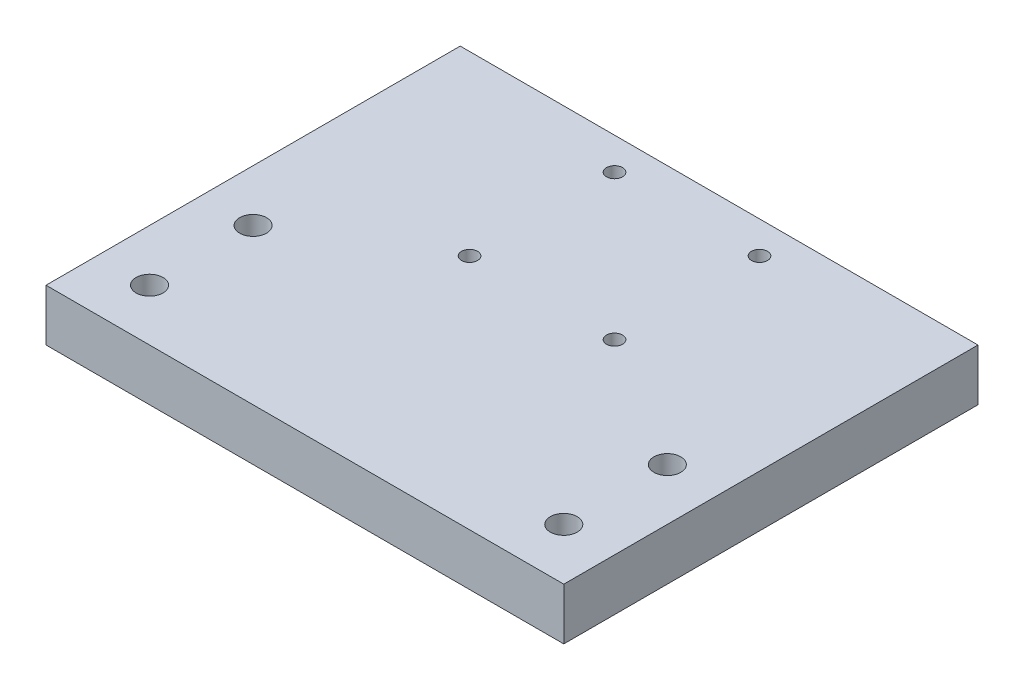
ISO-10303-21;
HEADER;
FILE_DESCRIPTION(('STEP AP214'),'2;1');
FILE_NAME('part.step','',(''),(''),'','','');
FILE_SCHEMA(('AUTOMOTIVE_DESIGN { 1 0 10303 214 1 1 1 1 }'));
ENDSEC;
DATA;
#1=APPLICATION_CONTEXT('core data for automotive mechanical design processes');
#2=APPLICATION_PROTOCOL_DEFINITION('international standard','automotive_design',2000,#1);
#3=PRODUCT_CONTEXT('',#1,'mechanical');
#4=PRODUCT('Part','Part','',(#3));
#5=PRODUCT_RELATED_PRODUCT_CATEGORY('part','',(#4));
#6=PRODUCT_DEFINITION_FORMATION('','',#4);
#7=PRODUCT_DEFINITION_CONTEXT('part definition',#1,'design');
#8=PRODUCT_DEFINITION('design','',#6,#7);
#9=PRODUCT_DEFINITION_SHAPE('','',#8);
#10=(LENGTH_UNIT() NAMED_UNIT(*) SI_UNIT(.MILLI.,.METRE.));
#11=(NAMED_UNIT(*) PLANE_ANGLE_UNIT() SI_UNIT($,.RADIAN.));
#12=(NAMED_UNIT(*) SI_UNIT($,.STERADIAN.) SOLID_ANGLE_UNIT());
#13=UNCERTAINTY_MEASURE_WITH_UNIT(LENGTH_MEASURE(1.E-05),#10,'distance_accuracy_value','');
#14=(GEOMETRIC_REPRESENTATION_CONTEXT(3) GLOBAL_UNCERTAINTY_ASSIGNED_CONTEXT((#13)) GLOBAL_UNIT_ASSIGNED_CONTEXT((#10,
#11,#12)) REPRESENTATION_CONTEXT('',''));
#15=CARTESIAN_POINT('',(0.,0.,0.));
#16=DIRECTION('',(0.,0.,1.));
#17=DIRECTION('',(1.,0.,0.));
#18=AXIS2_PLACEMENT_3D('',#15,#16,#17);
#19=CARTESIAN_POINT('',(50.,10.,-40.));
#20=DIRECTION('',(-1.,0.,0.));
#21=DIRECTION('',(0.,0.,1.));
#22=AXIS2_PLACEMENT_3D('',#19,#20,#21);
#23=PLANE('',#22);
#24=DIRECTION('',(0.,0.,-1.));
#25=VECTOR('',#24,1.);
#26=CARTESIAN_POINT('',(50.,0.,-40.));
#27=LINE('',#26,#25);
#28=CARTESIAN_POINT('',(50.,0.,40.));
#29=VERTEX_POINT('',#28);
#30=CARTESIAN_POINT('',(50.,0.,-40.));
#31=VERTEX_POINT('',#30);
#32=EDGE_CURVE('E106',#29,#31,#27,.T.);
#33=ORIENTED_EDGE('',*,*,#32,.T.);
#34=DIRECTION('',(0.,-1.,0.));
#35=VECTOR('',#34,1.);
#36=CARTESIAN_POINT('',(50.,10.,-40.));
#37=LINE('',#36,#35);
#38=CARTESIAN_POINT('',(50.,10.,-40.));
#39=VERTEX_POINT('',#38);
#40=EDGE_CURVE('E11',#39,#31,#37,.T.);
#41=ORIENTED_EDGE('',*,*,#40,.F.);
#42=DIRECTION('',(0.,0.,-1.));
#43=VECTOR('',#42,1.);
#44=CARTESIAN_POINT('',(50.,10.,-40.));
#45=LINE('',#44,#43);
#46=CARTESIAN_POINT('',(50.,10.,40.));
#47=VERTEX_POINT('',#46);
#48=EDGE_CURVE('E91',#47,#39,#45,.T.);
#49=ORIENTED_EDGE('',*,*,#48,.F.);
#50=DIRECTION('',(0.,-1.,0.));
#51=VECTOR('',#50,1.);
#52=CARTESIAN_POINT('',(50.,10.,40.));
#53=LINE('',#52,#51);
#54=EDGE_CURVE('E105',#47,#29,#53,.T.);
#55=ORIENTED_EDGE('',*,*,#54,.T.);
#56=EDGE_LOOP('',(#33,#41,#49,#55));
#57=FACE_BOUND('',#56,.T.);
#58=ADVANCED_FACE('F43',(#57),#23,.F.);
#59=CARTESIAN_POINT('',(-50.,10.,-40.));
#60=DIRECTION('',(0.,0.,1.));
#61=DIRECTION('',(1.,0.,0.));
#62=AXIS2_PLACEMENT_3D('',#59,#60,#61);
#63=PLANE('',#62);
#64=DIRECTION('',(-1.,0.,0.));
#65=VECTOR('',#64,1.);
#66=CARTESIAN_POINT('',(-50.,0.,-40.));
#67=LINE('',#66,#65);
#68=CARTESIAN_POINT('',(-50.,0.,-40.));
#69=VERTEX_POINT('',#68);
#70=EDGE_CURVE('E96',#31,#69,#67,.T.);
#71=ORIENTED_EDGE('',*,*,#70,.T.);
#72=DIRECTION('',(0.,-1.,0.));
#73=VECTOR('',#72,1.);
#74=CARTESIAN_POINT('',(-50.,10.,-40.));
#75=LINE('',#74,#73);
#76=CARTESIAN_POINT('',(-50.,10.,-40.));
#77=VERTEX_POINT('',#76);
#78=EDGE_CURVE('E51',#77,#69,#75,.T.);
#79=ORIENTED_EDGE('',*,*,#78,.F.);
#80=DIRECTION('',(-1.,0.,0.));
#81=VECTOR('',#80,1.);
#82=CARTESIAN_POINT('',(-50.,10.,-40.));
#83=LINE('',#82,#81);
#84=EDGE_CURVE('E90',#39,#77,#83,.T.);
#85=ORIENTED_EDGE('',*,*,#84,.F.);
#86=ORIENTED_EDGE('',*,*,#40,.T.);
#87=EDGE_LOOP('',(#71,#79,#85,#86));
#88=FACE_BOUND('',#87,.T.);
#89=ADVANCED_FACE('F97',(#88),#63,.F.);
#90=CARTESIAN_POINT('',(-50.,10.,-40.));
#91=DIRECTION('',(1.,0.,0.));
#92=DIRECTION('',(0.,0.,-1.));
#93=AXIS2_PLACEMENT_3D('',#90,#91,#92);
#94=PLANE('',#93);
#95=DIRECTION('',(0.,0.,1.));
#96=VECTOR('',#95,1.);
#97=CARTESIAN_POINT('',(-50.,0.,-40.));
#98=LINE('',#97,#96);
#99=CARTESIAN_POINT('',(-50.,0.,40.));
#100=VERTEX_POINT('',#99);
#101=EDGE_CURVE('E77',#69,#100,#98,.T.);
#102=ORIENTED_EDGE('',*,*,#101,.T.);
#103=DIRECTION('',(0.,-1.,0.));
#104=VECTOR('',#103,1.);
#105=CARTESIAN_POINT('',(-50.,10.,40.));
#106=LINE('',#105,#104);
#107=CARTESIAN_POINT('',(-50.,10.,40.));
#108=VERTEX_POINT('',#107);
#109=EDGE_CURVE('E100',#108,#100,#106,.T.);
#110=ORIENTED_EDGE('',*,*,#109,.F.);
#111=DIRECTION('',(0.,0.,1.));
#112=VECTOR('',#111,1.);
#113=CARTESIAN_POINT('',(-50.,10.,-40.));
#114=LINE('',#113,#112);
#115=EDGE_CURVE('E94',#77,#108,#114,.T.);
#116=ORIENTED_EDGE('',*,*,#115,.F.);
#117=ORIENTED_EDGE('',*,*,#78,.T.);
#118=EDGE_LOOP('',(#102,#110,#116,#117));
#119=FACE_BOUND('',#118,.T.);
#120=ADVANCED_FACE('F99',(#119),#94,.F.);
#121=CARTESIAN_POINT('',(-50.,10.,40.));
#122=DIRECTION('',(0.,0.,-1.));
#123=DIRECTION('',(-1.,0.,0.));
#124=AXIS2_PLACEMENT_3D('',#121,#122,#123);
#125=PLANE('',#124);
#126=DIRECTION('',(1.,0.,0.));
#127=VECTOR('',#126,1.);
#128=CARTESIAN_POINT('',(-50.,0.,40.));
#129=LINE('',#128,#127);
#130=EDGE_CURVE('E81',#100,#29,#129,.T.);
#131=ORIENTED_EDGE('',*,*,#130,.T.);
#132=ORIENTED_EDGE('',*,*,#54,.F.);
#133=DIRECTION('',(1.,0.,0.));
#134=VECTOR('',#133,1.);
#135=CARTESIAN_POINT('',(-50.,10.,40.));
#136=LINE('',#135,#134);
#137=EDGE_CURVE('E56',#108,#47,#136,.T.);
#138=ORIENTED_EDGE('',*,*,#137,.F.);
#139=ORIENTED_EDGE('',*,*,#109,.T.);
#140=EDGE_LOOP('',(#131,#132,#138,#139));
#141=FACE_BOUND('',#140,.T.);
#142=ADVANCED_FACE('F112',(#141),#125,.F.);
#143=CARTESIAN_POINT('',(0.,10.,0.));
#144=DIRECTION('',(0.,1.,0.));
#145=DIRECTION('',(0.,0.,1.));
#146=AXIS2_PLACEMENT_3D('',#143,#144,#145);
#147=PLANE('',#146);
#148=CARTESIAN_POINT('',(14.,10.,-5.80000000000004));
#149=DIRECTION('',(0.,1.,0.));
#150=DIRECTION('',(0.,0.,1.));
#151=AXIS2_PLACEMENT_3D('',#148,#149,#150);
#152=CIRCLE('',#151,1.55);
#153=CARTESIAN_POINT('',(14.,10.,-4.25000000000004));
#154=VERTEX_POINT('',#153);
#155=EDGE_CURVE('E146',#154,#154,#152,.T.);
#156=ORIENTED_EDGE('',*,*,#155,.F.);
#157=EDGE_LOOP('',(#156));
#158=FACE_BOUND('',#157,.T.);
#159=CARTESIAN_POINT('',(-14.,10.,-33.8));
#160=DIRECTION('',(0.,1.,0.));
#161=DIRECTION('',(0.,0.,1.));
#162=AXIS2_PLACEMENT_3D('',#159,#160,#161);
#163=CIRCLE('',#162,1.55);
#164=CARTESIAN_POINT('',(-14.,10.,-32.25));
#165=VERTEX_POINT('',#164);
#166=EDGE_CURVE('E152',#165,#165,#163,.T.);
#167=ORIENTED_EDGE('',*,*,#166,.F.);
#168=EDGE_LOOP('',(#167));
#169=FACE_BOUND('',#168,.T.);
#170=CARTESIAN_POINT('',(-14.,10.,-5.80000000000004));
#171=DIRECTION('',(0.,1.,0.));
#172=DIRECTION('',(0.,0.,1.));
#173=AXIS2_PLACEMENT_3D('',#170,#171,#172);
#174=CIRCLE('',#173,1.55);
#175=CARTESIAN_POINT('',(-14.,10.,-4.25000000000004));
#176=VERTEX_POINT('',#175);
#177=EDGE_CURVE('E155',#176,#176,#174,.T.);
#178=ORIENTED_EDGE('',*,*,#177,.F.);
#179=EDGE_LOOP('',(#178));
#180=FACE_BOUND('',#179,.T.);
#181=CARTESIAN_POINT('',(14.,10.,-33.8));
#182=DIRECTION('',(0.,1.,0.));
#183=DIRECTION('',(0.,0.,1.));
#184=AXIS2_PLACEMENT_3D('',#181,#182,#183);
#185=CIRCLE('',#184,1.55);
#186=CARTESIAN_POINT('',(14.,10.,-32.25));
#187=VERTEX_POINT('',#186);
#188=EDGE_CURVE('E144',#187,#187,#185,.T.);
#189=ORIENTED_EDGE('',*,*,#188,.F.);
#190=EDGE_LOOP('',(#189));
#191=FACE_BOUND('',#190,.T.);
#192=CARTESIAN_POINT('',(40.,10.,9.99999999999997));
#193=DIRECTION('',(0.,-1.,0.));
#194=DIRECTION('',(0.,0.,-1.));
#195=AXIS2_PLACEMENT_3D('',#192,#193,#194);
#196=CIRCLE('',#195,2.6);
#197=CARTESIAN_POINT('',(40.,10.,7.39999999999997));
#198=VERTEX_POINT('',#197);
#199=EDGE_CURVE('E132',#198,#198,#196,.T.);
#200=ORIENTED_EDGE('',*,*,#199,.T.);
#201=EDGE_LOOP('',(#200));
#202=FACE_BOUND('',#201,.T.);
#203=CARTESIAN_POINT('',(-40.,10.,30.));
#204=DIRECTION('',(0.,-1.,0.));
#205=DIRECTION('',(0.,0.,-1.));
#206=AXIS2_PLACEMENT_3D('',#203,#204,#205);
#207=CIRCLE('',#206,2.6);
#208=CARTESIAN_POINT('',(-40.,10.,27.4));
#209=VERTEX_POINT('',#208);
#210=EDGE_CURVE('E129',#209,#209,#207,.T.);
#211=ORIENTED_EDGE('',*,*,#210,.T.);
#212=EDGE_LOOP('',(#211));
#213=FACE_BOUND('',#212,.T.);
#214=CARTESIAN_POINT('',(-40.,10.,9.99999999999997));
#215=DIRECTION('',(0.,-1.,0.));
#216=DIRECTION('',(0.,0.,-1.));
#217=AXIS2_PLACEMENT_3D('',#214,#215,#216);
#218=CIRCLE('',#217,2.6);
#219=CARTESIAN_POINT('',(-40.,10.,7.39999999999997));
#220=VERTEX_POINT('',#219);
#221=EDGE_CURVE('E140',#220,#220,#218,.T.);
#222=ORIENTED_EDGE('',*,*,#221,.T.);
#223=EDGE_LOOP('',(#222));
#224=FACE_BOUND('',#223,.T.);
#225=CARTESIAN_POINT('',(40.,10.,30.));
#226=DIRECTION('',(0.,-1.,0.));
#227=DIRECTION('',(0.,0.,-1.));
#228=AXIS2_PLACEMENT_3D('',#225,#226,#227);
#229=CIRCLE('',#228,2.6);
#230=CARTESIAN_POINT('',(40.,10.,27.4));
#231=VERTEX_POINT('',#230);
#232=EDGE_CURVE('E107',#231,#231,#229,.T.);
#233=ORIENTED_EDGE('',*,*,#232,.T.);
#234=EDGE_LOOP('',(#233));
#235=FACE_BOUND('',#234,.T.);
#236=ORIENTED_EDGE('',*,*,#48,.T.);
#237=ORIENTED_EDGE('',*,*,#84,.T.);
#238=ORIENTED_EDGE('',*,*,#115,.T.);
#239=ORIENTED_EDGE('',*,*,#137,.T.);
#240=EDGE_LOOP('',(#236,#237,#238,#239));
#241=FACE_BOUND('',#240,.T.);
#242=ADVANCED_FACE('F86',(#158,#169,#180,#191,#202,#213,#224,#235,#241),#147,.T.);
#243=CARTESIAN_POINT('',(0.,0.,0.));
#244=DIRECTION('',(0.,1.,0.));
#245=DIRECTION('',(0.,0.,1.));
#246=AXIS2_PLACEMENT_3D('',#243,#244,#245);
#247=PLANE('',#246);
#248=CARTESIAN_POINT('',(14.,0.,-5.80000000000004));
#249=DIRECTION('',(0.,1.,0.));
#250=DIRECTION('',(0.,0.,1.));
#251=AXIS2_PLACEMENT_3D('',#248,#249,#250);
#252=CIRCLE('',#251,1.55);
#253=CARTESIAN_POINT('',(14.,0.,-4.25000000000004));
#254=VERTEX_POINT('',#253);
#255=EDGE_CURVE('E159',#254,#254,#252,.T.);
#256=ORIENTED_EDGE('',*,*,#255,.T.);
#257=EDGE_LOOP('',(#256));
#258=FACE_BOUND('',#257,.T.);
#259=CARTESIAN_POINT('',(-14.,0.,-33.8));
#260=DIRECTION('',(0.,1.,0.));
#261=DIRECTION('',(0.,0.,1.));
#262=AXIS2_PLACEMENT_3D('',#259,#260,#261);
#263=CIRCLE('',#262,1.55);
#264=CARTESIAN_POINT('',(-14.,0.,-32.25));
#265=VERTEX_POINT('',#264);
#266=EDGE_CURVE('E147',#265,#265,#263,.T.);
#267=ORIENTED_EDGE('',*,*,#266,.T.);
#268=EDGE_LOOP('',(#267));
#269=FACE_BOUND('',#268,.T.);
#270=CARTESIAN_POINT('',(-14.,0.,-5.80000000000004));
#271=DIRECTION('',(0.,1.,0.));
#272=DIRECTION('',(0.,0.,1.));
#273=AXIS2_PLACEMENT_3D('',#270,#271,#272);
#274=CIRCLE('',#273,1.55);
#275=CARTESIAN_POINT('',(-14.,0.,-4.25000000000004));
#276=VERTEX_POINT('',#275);
#277=EDGE_CURVE('E162',#276,#276,#274,.T.);
#278=ORIENTED_EDGE('',*,*,#277,.T.);
#279=EDGE_LOOP('',(#278));
#280=FACE_BOUND('',#279,.T.);
#281=CARTESIAN_POINT('',(14.,0.,-33.8));
#282=DIRECTION('',(0.,1.,0.));
#283=DIRECTION('',(0.,0.,1.));
#284=AXIS2_PLACEMENT_3D('',#281,#282,#283);
#285=CIRCLE('',#284,1.55);
#286=CARTESIAN_POINT('',(14.,0.,-32.25));
#287=VERTEX_POINT('',#286);
#288=EDGE_CURVE('E142',#287,#287,#285,.T.);
#289=ORIENTED_EDGE('',*,*,#288,.T.);
#290=EDGE_LOOP('',(#289));
#291=FACE_BOUND('',#290,.T.);
#292=CARTESIAN_POINT('',(40.,0.,9.99999999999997));
#293=DIRECTION('',(0.,-1.,0.));
#294=DIRECTION('',(0.,0.,-1.));
#295=AXIS2_PLACEMENT_3D('',#292,#293,#294);
#296=CIRCLE('',#295,2.6);
#297=CARTESIAN_POINT('',(40.,0.,7.39999999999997));
#298=VERTEX_POINT('',#297);
#299=EDGE_CURVE('E124',#298,#298,#296,.T.);
#300=ORIENTED_EDGE('',*,*,#299,.F.);
#301=EDGE_LOOP('',(#300));
#302=FACE_BOUND('',#301,.T.);
#303=CARTESIAN_POINT('',(-40.,0.,30.));
#304=DIRECTION('',(0.,-1.,0.));
#305=DIRECTION('',(0.,0.,-1.));
#306=AXIS2_PLACEMENT_3D('',#303,#304,#305);
#307=CIRCLE('',#306,2.6);
#308=CARTESIAN_POINT('',(-40.,0.,27.4));
#309=VERTEX_POINT('',#308);
#310=EDGE_CURVE('E128',#309,#309,#307,.T.);
#311=ORIENTED_EDGE('',*,*,#310,.F.);
#312=EDGE_LOOP('',(#311));
#313=FACE_BOUND('',#312,.T.);
#314=CARTESIAN_POINT('',(-40.,0.,9.99999999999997));
#315=DIRECTION('',(0.,-1.,0.));
#316=DIRECTION('',(0.,0.,-1.));
#317=AXIS2_PLACEMENT_3D('',#314,#315,#316);
#318=CIRCLE('',#317,2.6);
#319=CARTESIAN_POINT('',(-40.,0.,7.39999999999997));
#320=VERTEX_POINT('',#319);
#321=EDGE_CURVE('E127',#320,#320,#318,.T.);
#322=ORIENTED_EDGE('',*,*,#321,.F.);
#323=EDGE_LOOP('',(#322));
#324=FACE_BOUND('',#323,.T.);
#325=CARTESIAN_POINT('',(40.,0.,30.));
#326=DIRECTION('',(0.,-1.,0.));
#327=DIRECTION('',(0.,0.,-1.));
#328=AXIS2_PLACEMENT_3D('',#325,#326,#327);
#329=CIRCLE('',#328,2.6);
#330=CARTESIAN_POINT('',(40.,0.,27.4));
#331=VERTEX_POINT('',#330);
#332=EDGE_CURVE('E119',#331,#331,#329,.T.);
#333=ORIENTED_EDGE('',*,*,#332,.F.);
#334=EDGE_LOOP('',(#333));
#335=FACE_BOUND('',#334,.T.);
#336=ORIENTED_EDGE('',*,*,#32,.F.);
#337=ORIENTED_EDGE('',*,*,#130,.F.);
#338=ORIENTED_EDGE('',*,*,#101,.F.);
#339=ORIENTED_EDGE('',*,*,#70,.F.);
#340=EDGE_LOOP('',(#336,#337,#338,#339));
#341=FACE_BOUND('',#340,.T.);
#342=ADVANCED_FACE('F120',(#258,#269,#280,#291,#302,#313,#324,#335,#341),#247,.F.);
#343=CARTESIAN_POINT('',(40.,10.,30.));
#344=DIRECTION('',(0.,-1.,0.));
#345=DIRECTION('',(0.,0.,-1.));
#346=AXIS2_PLACEMENT_3D('',#343,#344,#345);
#347=CYLINDRICAL_SURFACE('',#346,2.6);
#348=ORIENTED_EDGE('',*,*,#232,.F.);
#349=EDGE_LOOP('',(#348));
#350=FACE_BOUND('',#349,.T.);
#351=ORIENTED_EDGE('',*,*,#332,.T.);
#352=EDGE_LOOP('',(#351));
#353=FACE_BOUND('',#352,.T.);
#354=ADVANCED_FACE('F183',(#350,#353),#347,.F.);
#355=CARTESIAN_POINT('',(-40.,10.,9.99999999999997));
#356=DIRECTION('',(0.,-1.,0.));
#357=DIRECTION('',(0.,0.,-1.));
#358=AXIS2_PLACEMENT_3D('',#355,#356,#357);
#359=CYLINDRICAL_SURFACE('',#358,2.6);
#360=ORIENTED_EDGE('',*,*,#221,.F.);
#361=EDGE_LOOP('',(#360));
#362=FACE_BOUND('',#361,.T.);
#363=ORIENTED_EDGE('',*,*,#321,.T.);
#364=EDGE_LOOP('',(#363));
#365=FACE_BOUND('',#364,.T.);
#366=ADVANCED_FACE('F190',(#362,#365),#359,.F.);
#367=CARTESIAN_POINT('',(-40.,10.,30.));
#368=DIRECTION('',(0.,-1.,0.));
#369=DIRECTION('',(0.,0.,-1.));
#370=AXIS2_PLACEMENT_3D('',#367,#368,#369);
#371=CYLINDRICAL_SURFACE('',#370,2.6);
#372=ORIENTED_EDGE('',*,*,#210,.F.);
#373=EDGE_LOOP('',(#372));
#374=FACE_BOUND('',#373,.T.);
#375=ORIENTED_EDGE('',*,*,#310,.T.);
#376=EDGE_LOOP('',(#375));
#377=FACE_BOUND('',#376,.T.);
#378=ADVANCED_FACE('F230',(#374,#377),#371,.F.);
#379=CARTESIAN_POINT('',(40.,10.,9.99999999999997));
#380=DIRECTION('',(0.,-1.,0.));
#381=DIRECTION('',(0.,0.,-1.));
#382=AXIS2_PLACEMENT_3D('',#379,#380,#381);
#383=CYLINDRICAL_SURFACE('',#382,2.6);
#384=ORIENTED_EDGE('',*,*,#199,.F.);
#385=EDGE_LOOP('',(#384));
#386=FACE_BOUND('',#385,.T.);
#387=ORIENTED_EDGE('',*,*,#299,.T.);
#388=EDGE_LOOP('',(#387));
#389=FACE_BOUND('',#388,.T.);
#390=ADVANCED_FACE('F239',(#386,#389),#383,.F.);
#391=CARTESIAN_POINT('',(14.,0.,-33.8));
#392=DIRECTION('',(0.,1.,0.));
#393=DIRECTION('',(0.,0.,1.));
#394=AXIS2_PLACEMENT_3D('',#391,#392,#393);
#395=CYLINDRICAL_SURFACE('',#394,1.55);
#396=ORIENTED_EDGE('',*,*,#288,.F.);
#397=EDGE_LOOP('',(#396));
#398=FACE_BOUND('',#397,.T.);
#399=ORIENTED_EDGE('',*,*,#188,.T.);
#400=EDGE_LOOP('',(#399));
#401=FACE_BOUND('',#400,.T.);
#402=ADVANCED_FACE('F248',(#398,#401),#395,.F.);
#403=CARTESIAN_POINT('',(-14.,0.,-5.80000000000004));
#404=DIRECTION('',(0.,1.,0.));
#405=DIRECTION('',(0.,0.,1.));
#406=AXIS2_PLACEMENT_3D('',#403,#404,#405);
#407=CYLINDRICAL_SURFACE('',#406,1.55);
#408=ORIENTED_EDGE('',*,*,#277,.F.);
#409=EDGE_LOOP('',(#408));
#410=FACE_BOUND('',#409,.T.);
#411=ORIENTED_EDGE('',*,*,#177,.T.);
#412=EDGE_LOOP('',(#411));
#413=FACE_BOUND('',#412,.T.);
#414=ADVANCED_FACE('F166',(#410,#413),#407,.F.);
#415=CARTESIAN_POINT('',(-14.,0.,-33.8));
#416=DIRECTION('',(0.,1.,0.));
#417=DIRECTION('',(0.,0.,1.));
#418=AXIS2_PLACEMENT_3D('',#415,#416,#417);
#419=CYLINDRICAL_SURFACE('',#418,1.55);
#420=ORIENTED_EDGE('',*,*,#266,.F.);
#421=EDGE_LOOP('',(#420));
#422=FACE_BOUND('',#421,.T.);
#423=ORIENTED_EDGE('',*,*,#166,.T.);
#424=EDGE_LOOP('',(#423));
#425=FACE_BOUND('',#424,.T.);
#426=ADVANCED_FACE('F283',(#422,#425),#419,.F.);
#427=CARTESIAN_POINT('',(14.,0.,-5.80000000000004));
#428=DIRECTION('',(0.,1.,0.));
#429=DIRECTION('',(0.,0.,1.));
#430=AXIS2_PLACEMENT_3D('',#427,#428,#429);
#431=CYLINDRICAL_SURFACE('',#430,1.55);
#432=ORIENTED_EDGE('',*,*,#255,.F.);
#433=EDGE_LOOP('',(#432));
#434=FACE_BOUND('',#433,.T.);
#435=ORIENTED_EDGE('',*,*,#155,.T.);
#436=EDGE_LOOP('',(#435));
#437=FACE_BOUND('',#436,.T.);
#438=ADVANCED_FACE('F288',(#434,#437),#431,.F.);
#439=CLOSED_SHELL('',(#58,#89,#120,#142,#242,#342,#354,#366,#378,#390,#402,#414,#426,#438));
#440=MANIFOLD_SOLID_BREP('B2',#439);
#441=ADVANCED_BREP_SHAPE_REPRESENTATION('',(#18,#440),#14);
#442=SHAPE_DEFINITION_REPRESENTATION(#9,#441);
ENDSEC;
END-ISO-10303-21;
